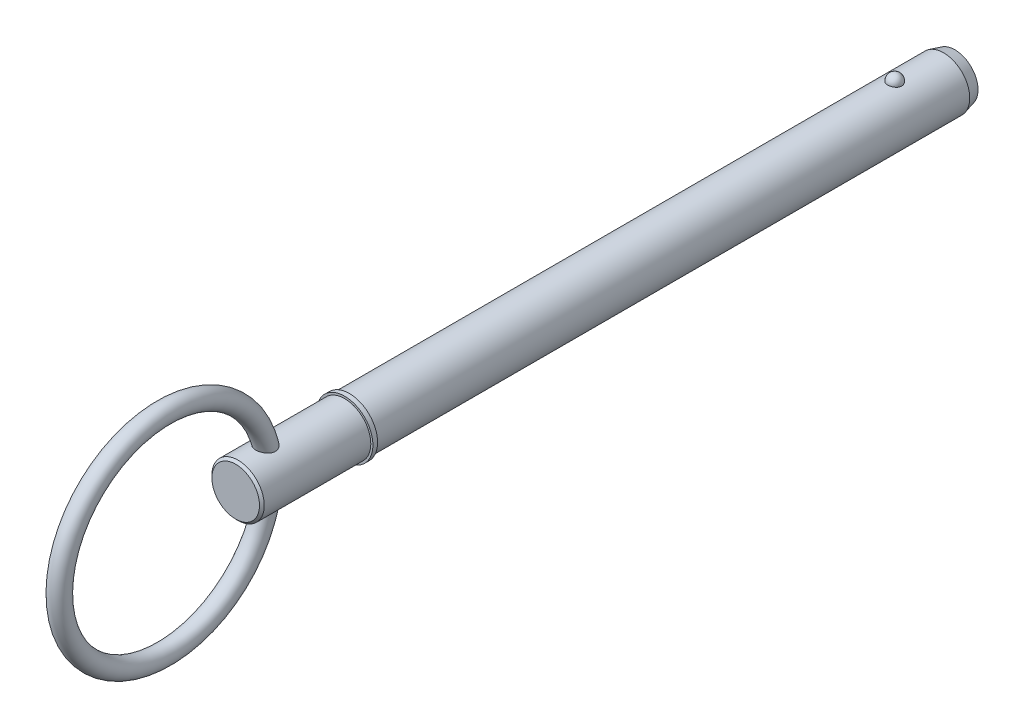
ISO-10303-21;
HEADER;
FILE_DESCRIPTION(('STEP AP214'),'2;1');
FILE_NAME('part.step','',(''),(''),'','','');
FILE_SCHEMA(('AUTOMOTIVE_DESIGN { 1 0 10303 214 1 1 1 1 }'));
ENDSEC;
DATA;
#1=APPLICATION_CONTEXT('core data for automotive mechanical design processes');
#2=APPLICATION_PROTOCOL_DEFINITION('international standard','automotive_design',2000,#1);
#3=PRODUCT_CONTEXT('',#1,'mechanical');
#4=PRODUCT('Part','Part','',(#3));
#5=PRODUCT_RELATED_PRODUCT_CATEGORY('part','',(#4));
#6=PRODUCT_DEFINITION_FORMATION('','',#4);
#7=PRODUCT_DEFINITION_CONTEXT('part definition',#1,'design');
#8=PRODUCT_DEFINITION('design','',#6,#7);
#9=PRODUCT_DEFINITION_SHAPE('','',#8);
#10=(LENGTH_UNIT() NAMED_UNIT(*) SI_UNIT(.MILLI.,.METRE.));
#11=(NAMED_UNIT(*) PLANE_ANGLE_UNIT() SI_UNIT($,.RADIAN.));
#12=(NAMED_UNIT(*) SI_UNIT($,.STERADIAN.) SOLID_ANGLE_UNIT());
#13=UNCERTAINTY_MEASURE_WITH_UNIT(LENGTH_MEASURE(1.E-05),#10,'distance_accuracy_value','');
#14=(GEOMETRIC_REPRESENTATION_CONTEXT(3) GLOBAL_UNCERTAINTY_ASSIGNED_CONTEXT((#13)) GLOBAL_UNIT_ASSIGNED_CONTEXT((#10,
#11,#12)) REPRESENTATION_CONTEXT('',''));
#15=CARTESIAN_POINT('',(0.,0.,0.));
#16=DIRECTION('',(0.,0.,1.));
#17=DIRECTION('',(1.,0.,0.));
#18=AXIS2_PLACEMENT_3D('',#15,#16,#17);
#19=CARTESIAN_POINT('',(0.,0.,114.3));
#20=DIRECTION('',(0.,0.,-1.));
#21=DIRECTION('',(-1.,0.,0.));
#22=AXIS2_PLACEMENT_3D('',#19,#20,#21);
#23=CYLINDRICAL_SURFACE('',#22,5.555);
#24=CARTESIAN_POINT('',(1.47653932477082,5.35517101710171,-1.49));
#25=CARTESIAN_POINT('',(1.4765376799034,5.35517235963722,-1.40667872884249));
#26=CARTESIAN_POINT('',(1.4697233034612,5.35706459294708,-1.32333626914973));
#27=CARTESIAN_POINT('',(1.4426291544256,5.36442332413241,-1.15900769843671));
#28=CARTESIAN_POINT('',(1.42234344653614,5.36989139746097,-1.07802264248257));
#29=CARTESIAN_POINT('',(1.36882802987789,5.38378061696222,-0.920757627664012));
#30=CARTESIAN_POINT('',(1.33560404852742,5.39220045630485,-0.844475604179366));
#31=CARTESIAN_POINT('',(1.25704906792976,5.41105136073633,-0.698703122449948));
#32=CARTESIAN_POINT('',(1.21171855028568,5.42148234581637,-0.629212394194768));
#33=CARTESIAN_POINT('',(1.10986325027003,5.44324765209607,-0.498626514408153));
#34=CARTESIAN_POINT('',(1.05328868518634,5.45458585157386,-0.437570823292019));
#35=CARTESIAN_POINT('',(0.930545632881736,5.4768596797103,-0.325918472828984));
#36=CARTESIAN_POINT('',(0.864377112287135,5.48779530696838,-0.275321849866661));
#37=CARTESIAN_POINT('',(0.724412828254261,5.50801510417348,-0.186125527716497));
#38=CARTESIAN_POINT('',(0.650637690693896,5.51730356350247,-0.147494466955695));
#39=CARTESIAN_POINT('',(0.497383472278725,5.53322345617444,-0.0831582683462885));
#40=CARTESIAN_POINT('',(0.417904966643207,5.53985515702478,-0.0574518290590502));
#41=CARTESIAN_POINT('',(0.256903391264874,5.54963245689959,-0.0200294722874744));
#42=CARTESIAN_POINT('',(0.17543580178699,5.55283384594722,-0.00808940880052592));
#43=CARTESIAN_POINT('',(0.011588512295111,5.55559187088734,0.00221439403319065));
#44=CARTESIAN_POINT('',(-0.0707911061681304,5.55514883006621,0.000579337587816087));
#45=CARTESIAN_POINT('',(-0.232980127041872,5.55069756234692,-0.0161051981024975));
#46=CARTESIAN_POINT('',(-0.312809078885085,5.54673626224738,-0.0309781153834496));
#47=CARTESIAN_POINT('',(-0.468771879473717,5.5357377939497,-0.0734743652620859));
#48=CARTESIAN_POINT('',(-0.544905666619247,5.52870057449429,-0.101097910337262));
#49=CARTESIAN_POINT('',(-0.691800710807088,5.51225307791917,-0.168516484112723));
#50=CARTESIAN_POINT('',(-0.762530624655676,5.50283015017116,-0.2083766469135));
#51=CARTESIAN_POINT('',(-0.896294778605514,5.48263289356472,-0.299136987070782));
#52=CARTESIAN_POINT('',(-0.959328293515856,5.47185843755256,-0.350038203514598));
#53=CARTESIAN_POINT('',(-1.07712789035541,5.44990641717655,-0.462517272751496));
#54=CARTESIAN_POINT('',(-1.13172901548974,5.43872509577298,-0.524267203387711));
#55=CARTESIAN_POINT('',(-1.2299173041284,5.41736658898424,-0.656133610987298));
#56=CARTESIAN_POINT('',(-1.2735037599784,5.40718946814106,-0.726250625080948));
#57=CARTESIAN_POINT('',(-1.34896420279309,5.38886361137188,-0.873713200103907));
#58=CARTESIAN_POINT('',(-1.38071142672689,5.38073711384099,-0.951126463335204));
#59=CARTESIAN_POINT('',(-1.4310375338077,5.36757288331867,-1.11037033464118));
#60=CARTESIAN_POINT('',(-1.44961676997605,5.3625350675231,-1.19220082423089));
#61=CARTESIAN_POINT('',(-1.47308754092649,5.35613553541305,-1.35761209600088));
#62=CARTESIAN_POINT('',(-1.47803294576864,5.35475935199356,-1.44118467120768));
#63=CARTESIAN_POINT('',(-1.47426441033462,5.35579807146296,-1.6079958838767));
#64=CARTESIAN_POINT('',(-1.46555080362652,5.35821288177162,-1.69123452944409));
#65=CARTESIAN_POINT('',(-1.43475662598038,5.36653964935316,-1.8546288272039));
#66=CARTESIAN_POINT('',(-1.41273621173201,5.37243586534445,-1.93479663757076));
#67=CARTESIAN_POINT('',(-1.35593151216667,5.38705199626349,-2.09020110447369));
#68=CARTESIAN_POINT('',(-1.32114675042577,5.39577201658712,-2.16543757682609));
#69=CARTESIAN_POINT('',(-1.23947506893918,5.41511674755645,-2.30926926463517));
#70=CARTESIAN_POINT('',(-1.1925277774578,5.42575087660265,-2.37782893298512));
#71=CARTESIAN_POINT('',(-1.08780725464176,5.44771095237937,-2.50598876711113));
#72=CARTESIAN_POINT('',(-1.03003365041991,5.4590369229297,-2.56558862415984));
#73=CARTESIAN_POINT('',(-0.90495349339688,5.48116073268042,-2.67436535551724));
#74=CARTESIAN_POINT('',(-0.837616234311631,5.49195671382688,-2.7235073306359));
#75=CARTESIAN_POINT('',(-0.69537970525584,5.51177099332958,-2.8097317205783));
#76=CARTESIAN_POINT('',(-0.620480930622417,5.52078940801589,-2.84681492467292));
#77=CARTESIAN_POINT('',(-0.466144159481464,5.53594369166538,-2.90749751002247));
#78=CARTESIAN_POINT('',(-0.386768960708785,5.54211181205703,-2.93124844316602));
#79=CARTESIAN_POINT('',(-0.224991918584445,5.5510324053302,-2.96523308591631));
#80=CARTESIAN_POINT('',(-0.142590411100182,5.55378525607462,-2.97546829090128));
#81=CARTESIAN_POINT('',(0.0213711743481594,5.55555351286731,-2.98206550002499));
#82=CARTESIAN_POINT('',(0.102921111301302,5.55463281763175,-2.97866468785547));
#83=CARTESIAN_POINT('',(0.2642564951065,5.54929804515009,-2.95862186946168));
#84=CARTESIAN_POINT('',(0.344041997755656,5.54488407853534,-2.94198028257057));
#85=CARTESIAN_POINT('',(0.499344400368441,5.53305794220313,-2.89600357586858));
#86=CARTESIAN_POINT('',(0.574874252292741,5.52565550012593,-2.86670961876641));
#87=CARTESIAN_POINT('',(0.71989857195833,5.50863937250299,-2.79624249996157));
#88=CARTESIAN_POINT('',(0.78939269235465,5.49902555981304,-2.75506865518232));
#89=CARTESIAN_POINT('',(0.921480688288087,5.47845199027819,-2.66127110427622));
#90=CARTESIAN_POINT('',(0.983960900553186,5.46747485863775,-2.60849118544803));
#91=CARTESIAN_POINT('',(1.09925057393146,5.44546837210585,-2.49325304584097));
#92=CARTESIAN_POINT('',(1.15205830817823,5.43443900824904,-2.43079310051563));
#93=CARTESIAN_POINT('',(1.24742943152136,5.41335152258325,-2.29680711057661));
#94=CARTESIAN_POINT('',(1.28981661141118,5.40331162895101,-2.22515272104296));
#95=CARTESIAN_POINT('',(1.36214937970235,5.38553336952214,-2.07558035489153));
#96=CARTESIAN_POINT('',(1.39210034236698,5.37779400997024,-1.99766510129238));
#97=CARTESIAN_POINT('',(1.43569518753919,5.36630594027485,-1.84848338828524));
#98=CARTESIAN_POINT('',(1.45098536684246,5.36216169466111,-1.77772322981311));
#99=CARTESIAN_POINT('',(1.47140805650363,5.35659367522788,-1.63464735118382));
#100=CARTESIAN_POINT('',(1.47654075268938,5.35516985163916,-1.5623316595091));
#101=CARTESIAN_POINT('',(1.47653932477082,5.35517101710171,-1.49));
#102=B_SPLINE_CURVE_WITH_KNOTS('',3,(#24,#25,#26,#27,#28,#29,#30,#31,#32,#33,#34,#35,#36,#37,
#38,#39,#40,#41,#42,#43,#44,#45,#46,#47,#48,#49,#50,#51,#52,#53,#54,#55,#56,#57,#58,#59,#60,#61,
#62,#63,#64,#65,#66,#67,#68,#69,#70,#71,#72,#73,#74,#75,#76,#77,#78,#79,#80,#81,#82,#83,#84,#85,
#86,#87,#88,#89,#90,#91,#92,#93,#94,#95,#96,#97,#98,#99,#100,#101),.UNSPECIFIED.,.T.,.F.,(4,2,2,
2,2,2,2,2,2,2,2,2,2,2,2,2,2,2,2,2,2,2,2,2,2,2,2,2,2,2,2,2,2,2,2,2,2,2,4),(0.,0.249703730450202,
0.4995175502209,0.749220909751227,0.998914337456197,1.24973894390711,1.50056442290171,
1.75072681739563,2.00086401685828,2.24686822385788,2.49285060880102,2.73560052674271,
2.97835449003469,3.22242369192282,3.46651587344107,3.71490232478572,3.96330473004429,
4.21429522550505,4.46527899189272,4.71526963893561,4.96525418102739,5.21411697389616,
5.46298905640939,5.71312097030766,5.96326150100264,6.21422412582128,6.46517032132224,
6.71320296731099,6.96120816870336,7.20491846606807,7.44862104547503,7.69153667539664,
7.93446627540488,8.18089104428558,8.42735976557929,8.67774679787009,8.92802551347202,
9.14479867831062,9.36156787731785),.UNSPECIFIED.);
#103=CARTESIAN_POINT('',(1.47653932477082,5.35517101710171,-1.49));
#104=VERTEX_POINT('',#103);
#105=EDGE_CURVE('E100',#104,#104,#102,.T.);
#106=ORIENTED_EDGE('',*,*,#105,.T.);
#107=EDGE_LOOP('',(#106));
#108=FACE_BOUND('',#107,.T.);
#109=CARTESIAN_POINT('',(0.,0.,-11.87));
#110=DIRECTION('',(0.,0.,-1.));
#111=DIRECTION('',(-1.,0.,0.));
#112=AXIS2_PLACEMENT_3D('',#109,#110,#111);
#113=CIRCLE('',#112,5.555);
#114=CARTESIAN_POINT('',(-5.555,0.,-11.87));
#115=VERTEX_POINT('',#114);
#116=EDGE_CURVE('E108',#115,#115,#113,.F.);
#117=ORIENTED_EDGE('',*,*,#116,.T.);
#118=EDGE_LOOP('',(#117));
#119=FACE_BOUND('',#118,.T.);
#120=CARTESIAN_POINT('',(0.,0.,114.3));
#121=DIRECTION('',(0.,0.,1.));
#122=DIRECTION('',(1.,0.,0.));
#123=AXIS2_PLACEMENT_3D('',#120,#121,#122);
#124=CIRCLE('',#123,5.555);
#125=CARTESIAN_POINT('',(5.555,0.,114.3));
#126=VERTEX_POINT('',#125);
#127=EDGE_CURVE('E106',#126,#126,#124,.T.);
#128=ORIENTED_EDGE('',*,*,#127,.F.);
#129=EDGE_LOOP('',(#128));
#130=FACE_BOUND('',#129,.T.);
#131=ADVANCED_FACE('F39',(#108,#119,#130),#23,.T.);
#132=CARTESIAN_POINT('',(0.,0.,-14.27));
#133=DIRECTION('',(0.,0.,-1.));
#134=DIRECTION('',(-1.,0.,0.));
#135=AXIS2_PLACEMENT_3D('',#132,#133,#134);
#136=PLANE('',#135);
#137=CARTESIAN_POINT('',(0.,0.,-14.27));
#138=DIRECTION('',(0.,0.,-1.));
#139=DIRECTION('',(-1.,0.,0.));
#140=AXIS2_PLACEMENT_3D('',#137,#138,#139);
#141=CIRCLE('',#140,4.9119219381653);
#142=CARTESIAN_POINT('',(-4.9119219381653,0.,-14.27));
#143=VERTEX_POINT('',#142);
#144=EDGE_CURVE('E141',#143,#143,#141,.T.);
#145=ORIENTED_EDGE('',*,*,#144,.T.);
#146=EDGE_LOOP('',(#145));
#147=FACE_BOUND('',#146,.T.);
#148=ADVANCED_FACE('F86',(#147),#136,.T.);
#149=CARTESIAN_POINT('',(0.,0.,-14.27));
#150=DIRECTION('',(0.,0.,1.));
#151=DIRECTION('',(1.,0.,0.));
#152=AXIS2_PLACEMENT_3D('',#149,#150,#151);
#153=CONICAL_SURFACE('',#152,4.9119219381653,0.261799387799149);
#154=ORIENTED_EDGE('',*,*,#116,.F.);
#155=EDGE_LOOP('',(#154));
#156=FACE_BOUND('',#155,.T.);
#157=ORIENTED_EDGE('',*,*,#144,.F.);
#158=EDGE_LOOP('',(#157));
#159=FACE_BOUND('',#158,.T.);
#160=ADVANCED_FACE('F92',(#156,#159),#153,.T.);
#161=CARTESIAN_POINT('',(0.,5.555,-1.49));
#162=DIRECTION('',(0.,1.,0.));
#163=DIRECTION('',(0.,0.,1.));
#164=AXIS2_PLACEMENT_3D('',#161,#162,#163);
#165=SPHERICAL_SURFACE('',#164,1.49);
#166=ORIENTED_EDGE('',*,*,#105,.F.);
#167=EDGE_LOOP('',(#166));
#168=FACE_BOUND('',#167,.T.);
#169=ADVANCED_FACE('F111',(#168),#165,.T.);
#170=CARTESIAN_POINT('',(0.,0.,114.3));
#171=DIRECTION('',(0.,0.,-1.));
#172=DIRECTION('',(-1.,0.,0.));
#173=AXIS2_PLACEMENT_3D('',#170,#171,#172);
#174=PLANE('',#173);
#175=ORIENTED_EDGE('',*,*,#127,.T.);
#176=EDGE_LOOP('',(#175));
#177=FACE_BOUND('',#176,.T.);
#178=CARTESIAN_POINT('',(0.,0.,114.3));
#179=DIRECTION('',(0.,0.,-1.));
#180=DIRECTION('',(-1.,0.,0.));
#181=AXIS2_PLACEMENT_3D('',#178,#179,#180);
#182=CIRCLE('',#181,6.);
#183=CARTESIAN_POINT('',(-6.,0.,114.3));
#184=VERTEX_POINT('',#183);
#185=EDGE_CURVE('E107',#184,#184,#182,.T.);
#186=ORIENTED_EDGE('',*,*,#185,.T.);
#187=EDGE_LOOP('',(#186));
#188=FACE_BOUND('',#187,.T.);
#189=ADVANCED_FACE('F115',(#177,#188),#174,.T.);
#190=CARTESIAN_POINT('',(0.,0.,33.7287874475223));
#191=DIRECTION('',(0.,0.,-1.));
#192=DIRECTION('',(-1.,0.,0.));
#193=AXIS2_PLACEMENT_3D('',#190,#191,#192);
#194=CYLINDRICAL_SURFACE('',#193,6.);
#195=CARTESIAN_POINT('',(0.,0.,115.3));
#196=DIRECTION('',(0.,0.,-1.));
#197=DIRECTION('',(-1.,0.,0.));
#198=AXIS2_PLACEMENT_3D('',#195,#196,#197);
#199=CIRCLE('',#198,6.);
#200=CARTESIAN_POINT('',(-6.,0.,115.3));
#201=VERTEX_POINT('',#200);
#202=EDGE_CURVE('E132',#201,#201,#199,.T.);
#203=ORIENTED_EDGE('',*,*,#202,.T.);
#204=EDGE_LOOP('',(#203));
#205=FACE_BOUND('',#204,.T.);
#206=ORIENTED_EDGE('',*,*,#185,.F.);
#207=EDGE_LOOP('',(#206));
#208=FACE_BOUND('',#207,.T.);
#209=ADVANCED_FACE('F119',(#205,#208),#194,.T.);
#210=CARTESIAN_POINT('',(0.,6.,115.3));
#211=DIRECTION('',(0.,0.,1.));
#212=DIRECTION('',(1.,0.,0.));
#213=AXIS2_PLACEMENT_3D('',#210,#211,#212);
#214=PLANE('',#213);
#215=CARTESIAN_POINT('',(0.,0.,115.3));
#216=DIRECTION('',(0.,0.,1.));
#217=DIRECTION('',(1.,0.,0.));
#218=AXIS2_PLACEMENT_3D('',#215,#216,#217);
#219=CIRCLE('',#218,5.555);
#220=CARTESIAN_POINT('',(5.555,0.,115.3));
#221=VERTEX_POINT('',#220);
#222=EDGE_CURVE('E110',#221,#221,#219,.T.);
#223=ORIENTED_EDGE('',*,*,#222,.F.);
#224=EDGE_LOOP('',(#223));
#225=FACE_BOUND('',#224,.T.);
#226=ORIENTED_EDGE('',*,*,#202,.F.);
#227=EDGE_LOOP('',(#226));
#228=FACE_BOUND('',#227,.T.);
#229=ADVANCED_FACE('F83',(#225,#228),#214,.T.);
#230=CARTESIAN_POINT('',(0.,0.,138.43));
#231=DIRECTION('',(0.,0.,-1.));
#232=DIRECTION('',(-1.,0.,0.));
#233=AXIS2_PLACEMENT_3D('',#230,#231,#232);
#234=CYLINDRICAL_SURFACE('',#233,5.555);
#235=CARTESIAN_POINT('',(-0.961380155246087,-5.47117658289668,130.308733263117));
#236=CARTESIAN_POINT('',(-0.863231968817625,-5.4884217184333,130.257515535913));
#237=CARTESIAN_POINT('',(-0.760548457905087,-5.50372118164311,130.214318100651));
#238=CARTESIAN_POINT('',(-0.548956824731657,-5.52883500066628,130.144912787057));
#239=CARTESIAN_POINT('',(-0.440048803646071,-5.53864944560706,130.118704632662));
#240=CARTESIAN_POINT('',(-0.219033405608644,-5.55178384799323,130.083864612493));
#241=CARTESIAN_POINT('',(-0.106925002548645,-5.55510169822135,130.075238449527));
#242=CARTESIAN_POINT('',(0.117238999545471,-5.55489351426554,130.075783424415));
#243=CARTESIAN_POINT('',(0.229294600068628,-5.55136768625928,130.084954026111));
#244=CARTESIAN_POINT('',(0.449588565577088,-5.5378711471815,130.120784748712));
#245=CARTESIAN_POINT('',(0.557843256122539,-5.52793284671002,130.147356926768));
#246=CARTESIAN_POINT('',(0.768116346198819,-5.50265785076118,130.217309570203));
#247=CARTESIAN_POINT('',(0.870134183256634,-5.48732066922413,130.260691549));
#248=CARTESIAN_POINT('',(1.06580880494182,-5.45270790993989,130.363685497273));
#249=CARTESIAN_POINT('',(1.1594033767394,-5.43340601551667,130.423406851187));
#250=CARTESIAN_POINT('',(1.33484934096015,-5.39298781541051,130.557672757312));
#251=CARTESIAN_POINT('',(1.41670019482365,-5.37187142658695,130.632217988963));
#252=CARTESIAN_POINT('',(1.56628651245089,-5.33017932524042,130.794433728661));
#253=CARTESIAN_POINT('',(1.63402728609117,-5.30960341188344,130.882099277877));
#254=CARTESIAN_POINT('',(1.75338323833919,-5.27139606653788,131.06835593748));
#255=CARTESIAN_POINT('',(1.80500413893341,-5.25376359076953,131.166943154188));
#256=CARTESIAN_POINT('',(1.88923054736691,-5.22405733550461,131.368866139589));
#257=CARTESIAN_POINT('',(1.92240068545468,-5.21182119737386,131.471942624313));
#258=CARTESIAN_POINT('',(1.97156802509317,-5.19342304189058,131.682612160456));
#259=CARTESIAN_POINT('',(1.98756752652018,-5.18726021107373,131.790204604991));
#260=CARTESIAN_POINT('',(2.00238957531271,-5.1815556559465,132.004813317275));
#261=CARTESIAN_POINT('',(2.0015062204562,-5.18190056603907,132.111807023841));
#262=CARTESIAN_POINT('',(1.98404322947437,-5.18861029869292,132.324294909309));
#263=CARTESIAN_POINT('',(1.96745884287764,-5.19497694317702,132.42978862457));
#264=CARTESIAN_POINT('',(1.91810947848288,-5.21340722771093,132.643734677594));
#265=CARTESIAN_POINT('',(1.88435438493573,-5.22581720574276,132.751927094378));
#266=CARTESIAN_POINT('',(1.80161540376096,-5.25491400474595,132.961718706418));
#267=CARTESIAN_POINT('',(1.7526231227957,-5.27160318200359,133.063314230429));
#268=CARTESIAN_POINT('',(1.63431251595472,-5.30955034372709,133.268856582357));
#269=CARTESIAN_POINT('',(1.5633341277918,-5.33111051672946,133.371796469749));
#270=CARTESIAN_POINT('',(1.4052960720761,-5.37493145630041,133.56447165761));
#271=CARTESIAN_POINT('',(1.31822569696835,-5.39719268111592,133.654198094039));
#272=CARTESIAN_POINT('',(1.12728892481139,-5.44031451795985,133.819004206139));
#273=CARTESIAN_POINT('',(1.02309899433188,-5.46113424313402,133.893723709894));
#274=CARTESIAN_POINT('',(0.801576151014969,-5.49800171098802,134.021805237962));
#275=CARTESIAN_POINT('',(0.684264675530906,-5.51405708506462,134.075201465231));
#276=CARTESIAN_POINT('',(0.45687763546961,-5.53719478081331,134.150980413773));
#277=CARTESIAN_POINT('',(0.34797457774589,-5.54519800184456,134.176584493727));
#278=CARTESIAN_POINT('',(0.127042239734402,-5.55464249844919,134.206731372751));
#279=CARTESIAN_POINT('',(0.015016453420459,-5.55609083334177,134.211296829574));
#280=CARTESIAN_POINT('',(-0.19199318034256,-5.55250986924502,134.199911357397));
#281=CARTESIAN_POINT('',(-0.287160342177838,-5.54836194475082,134.186752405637));
#282=CARTESIAN_POINT('',(-0.473863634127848,-5.53554271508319,134.145489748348));
#283=CARTESIAN_POINT('',(-0.565399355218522,-5.52687090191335,134.117384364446));
#284=CARTESIAN_POINT('',(-0.743786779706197,-5.50572322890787,134.047293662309));
#285=CARTESIAN_POINT('',(-0.830566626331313,-5.49320168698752,134.005141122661));
#286=CARTESIAN_POINT('',(-0.996720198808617,-5.46549909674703,133.908875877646));
#287=CARTESIAN_POINT('',(-1.07609119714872,-5.45031707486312,133.854758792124));
#288=CARTESIAN_POINT('',(-1.23672272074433,-5.41628785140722,133.728211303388));
#289=CARTESIAN_POINT('',(-1.3167603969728,-5.39722327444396,133.65428911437));
#290=CARTESIAN_POINT('',(-1.46504263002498,-5.3588760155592,133.495462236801));
#291=CARTESIAN_POINT('',(-1.5332782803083,-5.33959318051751,133.410549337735));
#292=CARTESIAN_POINT('',(-1.66602271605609,-5.29979878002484,133.218697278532));
#293=CARTESIAN_POINT('',(-1.72857256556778,-5.27951148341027,133.110347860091));
#294=CARTESIAN_POINT('',(-1.83559571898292,-5.24326402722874,132.884325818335));
#295=CARTESIAN_POINT('',(-1.88006296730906,-5.22730531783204,132.766650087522));
#296=CARTESIAN_POINT('',(-1.94988009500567,-5.20167534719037,132.522087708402));
#297=CARTESIAN_POINT('',(-1.97477410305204,-5.19215470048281,132.39505279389));
#298=CARTESIAN_POINT('',(-2.00168294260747,-5.18184594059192,132.138249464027));
#299=CARTESIAN_POINT('',(-2.00372217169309,-5.18104851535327,132.00848411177));
#300=CARTESIAN_POINT('',(-1.98467753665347,-5.18836681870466,131.764652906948));
#301=CARTESIAN_POINT('',(-1.96600067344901,-5.19555485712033,131.650370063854));
#302=CARTESIAN_POINT('',(-1.90923541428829,-5.21668050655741,131.427389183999));
#303=CARTESIAN_POINT('',(-1.87115335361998,-5.23061591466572,131.318689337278));
#304=CARTESIAN_POINT('',(-1.78015350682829,-5.26224244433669,131.118371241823));
#305=CARTESIAN_POINT('',(-1.72857344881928,-5.27957041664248,131.02608293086));
#306=CARTESIAN_POINT('',(-1.61106729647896,-5.31660340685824,130.851684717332));
#307=CARTESIAN_POINT('',(-1.54514024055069,-5.33630858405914,130.769575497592));
#308=CARTESIAN_POINT('',(-1.39929408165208,-5.37641320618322,130.615887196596));
#309=CARTESIAN_POINT('',(-1.31912544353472,-5.39681868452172,130.544546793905));
#310=CARTESIAN_POINT('',(-1.14786008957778,-5.43582099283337,130.415855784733));
#311=CARTESIAN_POINT('',(-1.05676174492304,-5.4544175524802,130.358507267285));
#312=CARTESIAN_POINT('',(-0.961380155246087,-5.47117658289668,130.308733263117));
#313=B_SPLINE_CURVE_WITH_KNOTS('',3,(#235,#236,#237,#238,#239,#240,#241,#242,#243,#244,#245,
#246,#247,#248,#249,#250,#251,#252,#253,#254,#255,#256,#257,#258,#259,#260,#261,#262,#263,#264,
#265,#266,#267,#268,#269,#270,#271,#272,#273,#274,#275,#276,#277,#278,#279,#280,#281,#282,#283,
#284,#285,#286,#287,#288,#289,#290,#291,#292,#293,#294,#295,#296,#297,#298,#299,#300,#301,#302,
#303,#304,#305,#306,#307,#308,#309,#310,#311,#312),.UNSPECIFIED.,.T.,.F.,(4,2,2,2,2,2,2,2,2,2,2,
2,2,2,2,2,2,2,2,2,2,2,2,2,2,2,2,2,2,2,2,2,2,2,2,2,2,2,4),(0.,0.335747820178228,
0.671490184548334,1.00734143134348,1.34318256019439,1.67733940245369,2.01152633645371,
2.34800767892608,2.6845044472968,3.02087435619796,3.35712472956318,3.68242216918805,
4.00767603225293,4.32726924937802,4.6469591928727,4.9876216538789,5.32847210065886,
5.7074287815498,6.08663853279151,6.47407889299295,6.86089527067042,7.19531213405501,
7.52936875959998,7.81649827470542,8.10366003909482,8.39437023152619,8.68518702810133,
9.01572837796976,9.34651809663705,9.72504519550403,10.1036989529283,10.4909301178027,
10.8777478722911,11.2239231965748,11.5699855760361,11.8899109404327,12.2098577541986,
12.5360928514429,12.8623766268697),.UNSPECIFIED.);
#314=CARTESIAN_POINT('',(-0.961380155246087,-5.47117658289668,130.308733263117));
#315=VERTEX_POINT('',#314);
#316=EDGE_CURVE('E10',#315,#315,#313,.T.);
#317=ORIENTED_EDGE('',*,*,#316,.F.);
#318=EDGE_LOOP('',(#317));
#319=FACE_BOUND('',#318,.T.);
#320=CARTESIAN_POINT('',(-0.961380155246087,5.47117658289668,130.308733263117));
#321=CARTESIAN_POINT('',(-1.05891474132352,5.45403910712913,130.359631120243));
#322=CARTESIAN_POINT('',(-1.15197270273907,5.43497920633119,130.418451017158));
#323=CARTESIAN_POINT('',(-1.32661268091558,5.39501222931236,130.55070162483));
#324=CARTESIAN_POINT('',(-1.40819495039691,5.37410519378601,130.624132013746));
#325=CARTESIAN_POINT('',(-1.55769110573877,5.33269731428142,130.784098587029));
#326=CARTESIAN_POINT('',(-1.62558729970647,5.31219702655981,130.870651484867));
#327=CARTESIAN_POINT('',(-1.74556031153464,5.2739951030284,131.054646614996));
#328=CARTESIAN_POINT('',(-1.7976419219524,5.25629262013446,131.152085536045));
#329=CARTESIAN_POINT('',(-1.88339939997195,5.22617061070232,131.352565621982));
#330=CARTESIAN_POINT('',(-1.91750373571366,5.21362983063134,131.455405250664));
#331=CARTESIAN_POINT('',(-1.96852412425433,5.194582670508,131.665778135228));
#332=CARTESIAN_POINT('',(-1.98544249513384,5.18807547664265,131.773310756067));
#333=CARTESIAN_POINT('',(-2.00201964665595,5.18170011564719,131.987819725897));
#334=CARTESIAN_POINT('',(-2.00199605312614,5.18170977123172,132.094768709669));
#335=CARTESIAN_POINT('',(-1.98621575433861,5.18777751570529,132.307306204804));
#336=CARTESIAN_POINT('',(-1.97045441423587,5.19383738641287,132.412894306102));
#337=CARTESIAN_POINT('',(-1.92280904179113,5.21167084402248,132.626914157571));
#338=CARTESIAN_POINT('',(-1.88996782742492,5.22378174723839,132.735103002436));
#339=CARTESIAN_POINT('',(-1.80906901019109,5.25234475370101,132.945029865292));
#340=CARTESIAN_POINT('',(-1.76100319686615,5.26879919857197,133.046764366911));
#341=CARTESIAN_POINT('',(-1.64464870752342,5.30634509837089,133.252788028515));
#342=CARTESIAN_POINT('',(-1.57469702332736,5.32774959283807,133.356085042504));
#343=CARTESIAN_POINT('',(-1.41872356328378,5.37138743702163,133.549688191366));
#344=CARTESIAN_POINT('',(-1.3326906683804,5.39362135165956,133.639985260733));
#345=CARTESIAN_POINT('',(-1.14345202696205,5.43692909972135,133.806557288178));
#346=CARTESIAN_POINT('',(-1.03986000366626,5.45795811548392,133.882409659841));
#347=CARTESIAN_POINT('',(-0.819338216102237,5.49537389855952,134.012916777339));
#348=CARTESIAN_POINT('',(-0.702429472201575,5.51176784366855,134.067604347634));
#349=CARTESIAN_POINT('',(-0.475167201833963,5.53565843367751,134.14602203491));
#350=CARTESIAN_POINT('',(-0.365997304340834,5.5440461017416,134.172893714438));
#351=CARTESIAN_POINT('',(-0.144272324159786,5.55422966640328,134.205426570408));
#352=CARTESIAN_POINT('',(-0.0317212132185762,5.55603301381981,134.211111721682));
#353=CARTESIAN_POINT('',(0.176166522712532,5.55303883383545,134.201592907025));
#354=CARTESIAN_POINT('',(0.271662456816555,5.54914868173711,134.189260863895));
#355=CARTESIAN_POINT('',(0.45914083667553,5.53678955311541,134.149523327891));
#356=CARTESIAN_POINT('',(0.551122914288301,5.52832009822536,134.122116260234));
#357=CARTESIAN_POINT('',(0.730082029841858,5.50755841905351,134.053437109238));
#358=CARTESIAN_POINT('',(0.817013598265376,5.49523641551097,134.012056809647));
#359=CARTESIAN_POINT('',(0.983569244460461,5.46788364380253,133.917293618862));
#360=CARTESIAN_POINT('',(1.06319070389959,5.45285191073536,133.863906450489));
#361=CARTESIAN_POINT('',(1.22430017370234,5.4191117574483,133.738982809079));
#362=CARTESIAN_POINT('',(1.30459540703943,5.40018081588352,133.665970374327));
#363=CARTESIAN_POINT('',(1.45353150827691,5.3620139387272,133.508943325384));
#364=CARTESIAN_POINT('',(1.52216366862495,5.3427777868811,133.424920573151));
#365=CARTESIAN_POINT('',(1.65601602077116,5.30294271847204,133.234811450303));
#366=CARTESIAN_POINT('',(1.71927851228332,5.28255425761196,133.127294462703));
#367=CARTESIAN_POINT('',(1.82790996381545,5.24595721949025,132.902847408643));
#368=CARTESIAN_POINT('',(1.8732722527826,5.22975020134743,132.785913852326));
#369=CARTESIAN_POINT('',(1.94526503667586,5.20341207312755,132.542194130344));
#370=CARTESIAN_POINT('',(1.97135787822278,5.1934564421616,132.41522738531));
#371=CARTESIAN_POINT('',(2.00068973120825,5.18223330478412,132.158318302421));
#372=CARTESIAN_POINT('',(2.00395290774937,5.18095661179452,132.028379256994));
#373=CARTESIAN_POINT('',(1.98717985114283,5.1874070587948,131.783763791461));
#374=CARTESIAN_POINT('',(1.96951989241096,5.19421607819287,131.668899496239));
#375=CARTESIAN_POINT('',(1.91463360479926,5.2146960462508,131.444589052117));
#376=CARTESIAN_POINT('',(1.87741409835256,5.22836460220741,131.335141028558));
#377=CARTESIAN_POINT('',(1.78800305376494,5.25957304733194,131.133542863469));
#378=CARTESIAN_POINT('',(1.73720600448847,5.27672774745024,131.040709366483));
#379=CARTESIAN_POINT('',(1.62116201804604,5.3135255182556,130.865121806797));
#380=CARTESIAN_POINT('',(1.55591428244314,5.33316872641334,130.782368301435));
#381=CARTESIAN_POINT('',(1.41164041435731,5.37317145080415,130.627648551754));
#382=CARTESIAN_POINT('',(1.33241957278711,5.39353732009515,130.555865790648));
#383=CARTESIAN_POINT('',(1.16300716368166,5.43258596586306,130.426112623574));
#384=CARTESIAN_POINT('',(1.07281393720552,5.45126848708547,130.368144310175));
#385=CARTESIAN_POINT('',(0.880638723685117,5.48564753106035,130.265507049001));
#386=CARTESIAN_POINT('',(0.778364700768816,5.50122427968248,130.221343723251));
#387=CARTESIAN_POINT('',(0.567418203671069,5.52696543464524,130.149973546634));
#388=CARTESIAN_POINT('',(0.458745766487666,5.53712987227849,130.12276659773));
#389=CARTESIAN_POINT('',(0.237791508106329,5.55101406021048,130.085879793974));
#390=CARTESIAN_POINT('',(0.125501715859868,5.55471842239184,130.07624178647));
#391=CARTESIAN_POINT('',(-0.0992056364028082,5.55525045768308,130.074849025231));
#392=CARTESIAN_POINT('',(-0.211623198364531,5.55207802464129,130.083094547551));
#393=CARTESIAN_POINT('',(-0.434217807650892,5.53913427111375,130.117408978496));
#394=CARTESIAN_POINT('',(-0.544370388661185,5.5293114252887,130.143617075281));
#395=CARTESIAN_POINT('',(-0.758352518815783,5.50404767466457,130.213395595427));
#396=CARTESIAN_POINT('',(-0.862181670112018,5.48860641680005,130.256967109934));
#397=CARTESIAN_POINT('',(-0.961380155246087,5.47117658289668,130.308733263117));
#398=B_SPLINE_CURVE_WITH_KNOTS('',3,(#320,#321,#322,#323,#324,#325,#326,#327,#328,#329,#330,
#331,#332,#333,#334,#335,#336,#337,#338,#339,#340,#341,#342,#343,#344,#345,#346,#347,#348,#349,
#350,#351,#352,#353,#354,#355,#356,#357,#358,#359,#360,#361,#362,#363,#364,#365,#366,#367,#368,
#369,#370,#371,#372,#373,#374,#375,#376,#377,#378,#379,#380,#381,#382,#383,#384,#385,#386,#387,
#388,#389,#390,#391,#392,#393,#394,#395,#396,#397),.UNSPECIFIED.,.T.,.F.,(4,2,2,2,2,2,2,2,2,2,2,
2,2,2,2,2,2,2,2,2,2,2,2,2,2,2,2,2,2,2,2,2,2,2,2,2,2,2,4),(0.,0.333636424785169,
0.667265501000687,1.00132312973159,1.3352794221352,1.6608682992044,1.98641325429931,
2.30585509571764,2.62539104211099,2.96514840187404,3.3050893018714,3.68313901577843,
4.06145109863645,4.44953802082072,4.83702062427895,5.17316628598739,5.50893144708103,
5.79666415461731,6.08442692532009,6.37447144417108,6.66461944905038,6.99384361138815,
7.32331250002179,7.70083591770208,8.07849989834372,8.46633986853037,8.8537692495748,
9.20110411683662,9.54831791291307,9.86844524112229,10.1885902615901,10.5136110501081,
10.8386810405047,11.1745469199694,11.5104108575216,11.847073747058,12.183741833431,
12.5230486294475,12.8623767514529),.UNSPECIFIED.);
#399=CARTESIAN_POINT('',(-0.961380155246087,5.47117658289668,130.308733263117));
#400=VERTEX_POINT('',#399);
#401=EDGE_CURVE('E51',#400,#400,#398,.T.);
#402=ORIENTED_EDGE('',*,*,#401,.F.);
#403=EDGE_LOOP('',(#402));
#404=FACE_BOUND('',#403,.T.);
#405=CARTESIAN_POINT('',(0.,0.,137.93));
#406=DIRECTION('',(0.,0.,-1.));
#407=DIRECTION('',(-1.,0.,0.));
#408=AXIS2_PLACEMENT_3D('',#405,#406,#407);
#409=CIRCLE('',#408,5.555);
#410=CARTESIAN_POINT('',(-5.555,0.,137.93));
#411=VERTEX_POINT('',#410);
#412=EDGE_CURVE('E62',#411,#411,#409,.T.);
#413=ORIENTED_EDGE('',*,*,#412,.T.);
#414=EDGE_LOOP('',(#413));
#415=FACE_BOUND('',#414,.T.);
#416=ORIENTED_EDGE('',*,*,#222,.T.);
#417=EDGE_LOOP('',(#416));
#418=FACE_BOUND('',#417,.T.);
#419=ADVANCED_FACE('F67',(#319,#404,#415,#418),#234,.T.);
#420=CARTESIAN_POINT('',(0.,0.,138.43));
#421=DIRECTION('',(0.,0.,-1.));
#422=DIRECTION('',(-1.,0.,0.));
#423=AXIS2_PLACEMENT_3D('',#420,#421,#422);
#424=PLANE('',#423);
#425=CARTESIAN_POINT('',(0.,0.,138.43));
#426=DIRECTION('',(0.,0.,-1.));
#427=DIRECTION('',(-1.,0.,0.));
#428=AXIS2_PLACEMENT_3D('',#425,#426,#427);
#429=CIRCLE('',#428,5.05499999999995);
#430=CARTESIAN_POINT('',(-5.05499999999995,0.,138.43));
#431=VERTEX_POINT('',#430);
#432=EDGE_CURVE('E57',#431,#431,#429,.F.);
#433=ORIENTED_EDGE('',*,*,#432,.T.);
#434=EDGE_LOOP('',(#433));
#435=FACE_BOUND('',#434,.T.);
#436=ADVANCED_FACE('F74',(#435),#424,.F.);
#437=CARTESIAN_POINT('',(0.,0.,137.93));
#438=DIRECTION('',(0.,0.,-1.));
#439=DIRECTION('',(-1.,0.,0.));
#440=AXIS2_PLACEMENT_3D('',#437,#438,#439);
#441=CONICAL_SURFACE('',#440,5.555,0.785398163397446);
#442=ORIENTED_EDGE('',*,*,#432,.F.);
#443=EDGE_LOOP('',(#442));
#444=FACE_BOUND('',#443,.T.);
#445=ORIENTED_EDGE('',*,*,#412,.F.);
#446=EDGE_LOOP('',(#445));
#447=FACE_BOUND('',#446,.T.);
#448=ADVANCED_FACE('F41',(#444,#447),#441,.T.);
#449=CARTESIAN_POINT('',(0.,0.,153.655));
#450=DIRECTION('',(1.,0.,0.));
#451=DIRECTION('',(0.,0.,-1.));
#452=AXIS2_PLACEMENT_3D('',#449,#450,#451);
#453=TOROIDAL_SURFACE('',#452,22.225,2.);
#454=ORIENTED_EDGE('',*,*,#316,.T.);
#455=EDGE_LOOP('',(#454));
#456=FACE_BOUND('',#455,.T.);
#457=ORIENTED_EDGE('',*,*,#401,.T.);
#458=EDGE_LOOP('',(#457));
#459=FACE_BOUND('',#458,.T.);
#460=ADVANCED_FACE('F71',(#456,#459),#453,.T.);
#461=CLOSED_SHELL('',(#131,#148,#160,#169,#189,#209,#229,#419,#436,#448,#460));
#462=MANIFOLD_SOLID_BREP('B2',#461);
#463=ADVANCED_BREP_SHAPE_REPRESENTATION('',(#18,#462),#14);
#464=SHAPE_DEFINITION_REPRESENTATION(#9,#463);
ENDSEC;
END-ISO-10303-21;
